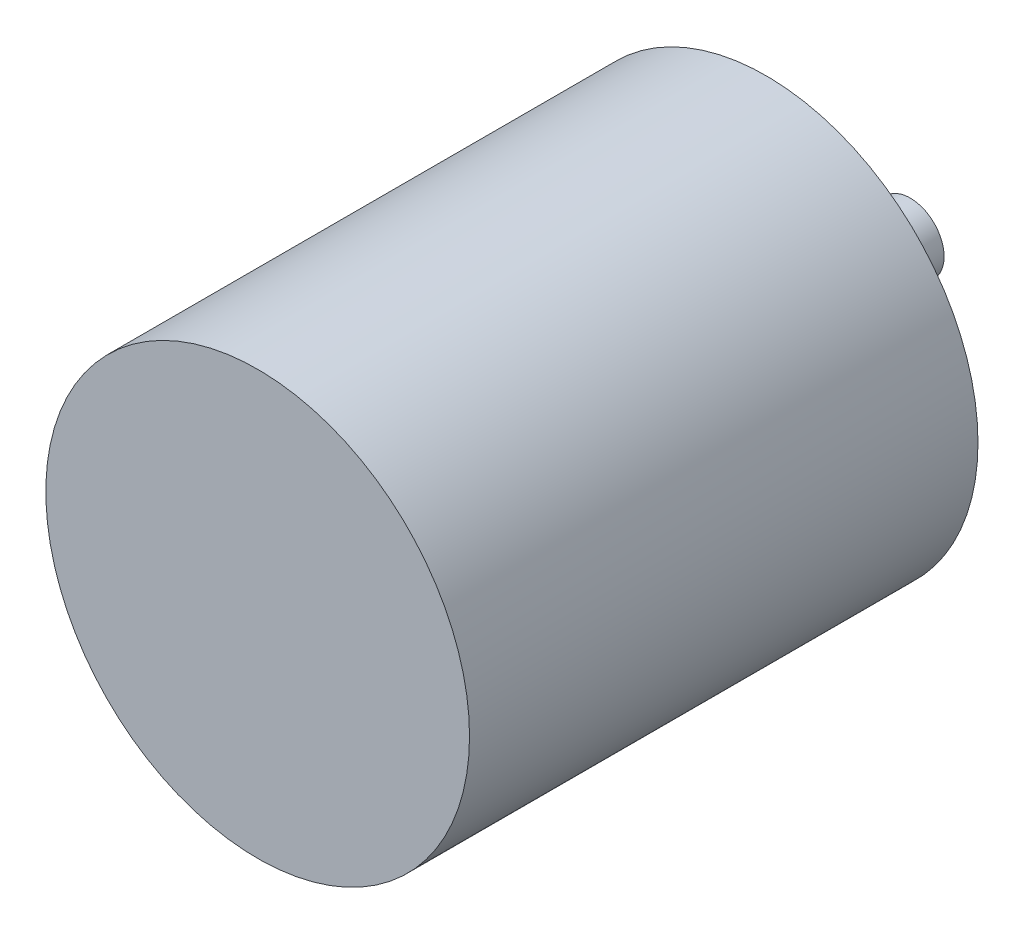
ISO-10303-21;
HEADER;
FILE_DESCRIPTION(('STEP AP214'),'2;1');
FILE_NAME('part.step','',(''),(''),'','','');
FILE_SCHEMA(('AUTOMOTIVE_DESIGN { 1 0 10303 214 1 1 1 1 }'));
ENDSEC;
DATA;
#1=APPLICATION_CONTEXT('core data for automotive mechanical design processes');
#2=APPLICATION_PROTOCOL_DEFINITION('international standard','automotive_design',2000,#1);
#3=PRODUCT_CONTEXT('',#1,'mechanical');
#4=PRODUCT('Part','Part','',(#3));
#5=PRODUCT_RELATED_PRODUCT_CATEGORY('part','',(#4));
#6=PRODUCT_DEFINITION_FORMATION('','',#4);
#7=PRODUCT_DEFINITION_CONTEXT('part definition',#1,'design');
#8=PRODUCT_DEFINITION('design','',#6,#7);
#9=PRODUCT_DEFINITION_SHAPE('','',#8);
#10=(LENGTH_UNIT() NAMED_UNIT(*) SI_UNIT(.MILLI.,.METRE.));
#11=(NAMED_UNIT(*) PLANE_ANGLE_UNIT() SI_UNIT($,.RADIAN.));
#12=(NAMED_UNIT(*) SI_UNIT($,.STERADIAN.) SOLID_ANGLE_UNIT());
#13=UNCERTAINTY_MEASURE_WITH_UNIT(LENGTH_MEASURE(1.E-05),#10,'distance_accuracy_value','');
#14=(GEOMETRIC_REPRESENTATION_CONTEXT(3) GLOBAL_UNCERTAINTY_ASSIGNED_CONTEXT((#13)) GLOBAL_UNIT_ASSIGNED_CONTEXT((#10,
#11,#12)) REPRESENTATION_CONTEXT('',''));
#15=CARTESIAN_POINT('',(0.,0.,0.));
#16=DIRECTION('',(0.,0.,1.));
#17=DIRECTION('',(1.,0.,0.));
#18=AXIS2_PLACEMENT_3D('',#15,#16,#17);
#19=CARTESIAN_POINT('',(0.,0.,60.));
#20=DIRECTION('',(0.,0.,-1.));
#21=DIRECTION('',(-1.,0.,0.));
#22=AXIS2_PLACEMENT_3D('',#19,#20,#21);
#23=CYLINDRICAL_SURFACE('',#22,25.);
#24=CARTESIAN_POINT('',(0.,0.,60.));
#25=DIRECTION('',(0.,0.,1.));
#26=DIRECTION('',(1.,0.,0.));
#27=AXIS2_PLACEMENT_3D('',#24,#25,#26);
#28=CIRCLE('',#27,25.);
#29=CARTESIAN_POINT('',(25.,0.,60.));
#30=VERTEX_POINT('',#29);
#31=EDGE_CURVE('E10',#30,#30,#28,.T.);
#32=ORIENTED_EDGE('',*,*,#31,.F.);
#33=EDGE_LOOP('',(#32));
#34=FACE_BOUND('',#33,.T.);
#35=CARTESIAN_POINT('',(0.,0.,0.));
#36=DIRECTION('',(0.,0.,1.));
#37=DIRECTION('',(1.,0.,0.));
#38=AXIS2_PLACEMENT_3D('',#35,#36,#37);
#39=CIRCLE('',#38,25.);
#40=CARTESIAN_POINT('',(25.,0.,0.));
#41=VERTEX_POINT('',#40);
#42=EDGE_CURVE('E46',#41,#41,#39,.T.);
#43=ORIENTED_EDGE('',*,*,#42,.T.);
#44=EDGE_LOOP('',(#43));
#45=FACE_BOUND('',#44,.T.);
#46=ADVANCED_FACE('F43',(#34,#45),#23,.T.);
#47=CARTESIAN_POINT('',(0.,0.,60.));
#48=DIRECTION('',(0.,0.,1.));
#49=DIRECTION('',(1.,0.,0.));
#50=AXIS2_PLACEMENT_3D('',#47,#48,#49);
#51=PLANE('',#50);
#52=ORIENTED_EDGE('',*,*,#31,.T.);
#53=EDGE_LOOP('',(#52));
#54=FACE_BOUND('',#53,.T.);
#55=ADVANCED_FACE('F103',(#54),#51,.T.);
#56=CARTESIAN_POINT('',(0.,0.,0.));
#57=DIRECTION('',(0.,0.,1.));
#58=DIRECTION('',(1.,0.,0.));
#59=AXIS2_PLACEMENT_3D('',#56,#57,#58);
#60=PLANE('',#59);
#61=CARTESIAN_POINT('',(-10.,-10.,0.));
#62=DIRECTION('',(0.,0.,-1.));
#63=DIRECTION('',(-1.,0.,0.));
#64=AXIS2_PLACEMENT_3D('',#61,#62,#63);
#65=CIRCLE('',#64,3.);
#66=CARTESIAN_POINT('',(-13.,-10.,0.));
#67=VERTEX_POINT('',#66);
#68=EDGE_CURVE('E77',#67,#67,#65,.T.);
#69=ORIENTED_EDGE('',*,*,#68,.F.);
#70=EDGE_LOOP('',(#69));
#71=FACE_BOUND('',#70,.T.);
#72=CARTESIAN_POINT('',(10.,-10.,0.));
#73=DIRECTION('',(0.,0.,-1.));
#74=DIRECTION('',(-1.,0.,0.));
#75=AXIS2_PLACEMENT_3D('',#72,#73,#74);
#76=CIRCLE('',#75,3.);
#77=CARTESIAN_POINT('',(7.,-10.,0.));
#78=VERTEX_POINT('',#77);
#79=EDGE_CURVE('E85',#78,#78,#76,.T.);
#80=ORIENTED_EDGE('',*,*,#79,.F.);
#81=EDGE_LOOP('',(#80));
#82=FACE_BOUND('',#81,.T.);
#83=CARTESIAN_POINT('',(10.,10.,0.));
#84=DIRECTION('',(0.,0.,-1.));
#85=DIRECTION('',(-1.,0.,0.));
#86=AXIS2_PLACEMENT_3D('',#83,#84,#85);
#87=CIRCLE('',#86,3.);
#88=CARTESIAN_POINT('',(7.,10.,0.));
#89=VERTEX_POINT('',#88);
#90=EDGE_CURVE('E69',#89,#89,#87,.T.);
#91=ORIENTED_EDGE('',*,*,#90,.F.);
#92=EDGE_LOOP('',(#91));
#93=FACE_BOUND('',#92,.T.);
#94=CARTESIAN_POINT('',(-10.,10.,0.));
#95=DIRECTION('',(0.,0.,-1.));
#96=DIRECTION('',(-1.,0.,0.));
#97=AXIS2_PLACEMENT_3D('',#94,#95,#96);
#98=CIRCLE('',#97,3.);
#99=CARTESIAN_POINT('',(-13.,10.,0.));
#100=VERTEX_POINT('',#99);
#101=EDGE_CURVE('E65',#100,#100,#98,.T.);
#102=ORIENTED_EDGE('',*,*,#101,.F.);
#103=EDGE_LOOP('',(#102));
#104=FACE_BOUND('',#103,.T.);
#105=CARTESIAN_POINT('',(0.,0.,0.));
#106=DIRECTION('',(0.,0.,1.));
#107=DIRECTION('',(1.,0.,0.));
#108=AXIS2_PLACEMENT_3D('',#105,#106,#107);
#109=CIRCLE('',#108,4.);
#110=CARTESIAN_POINT('',(4.,0.,0.));
#111=VERTEX_POINT('',#110);
#112=EDGE_CURVE('E57',#111,#111,#109,.T.);
#113=ORIENTED_EDGE('',*,*,#112,.T.);
#114=EDGE_LOOP('',(#113));
#115=FACE_BOUND('',#114,.T.);
#116=ORIENTED_EDGE('',*,*,#42,.F.);
#117=EDGE_LOOP('',(#116));
#118=FACE_BOUND('',#117,.T.);
#119=ADVANCED_FACE('F99',(#71,#82,#93,#104,#115,#118),#60,.F.);
#120=CARTESIAN_POINT('',(0.,0.,-17.));
#121=DIRECTION('',(0.,0.,1.));
#122=DIRECTION('',(1.,0.,0.));
#123=AXIS2_PLACEMENT_3D('',#120,#121,#122);
#124=CYLINDRICAL_SURFACE('',#123,4.);
#125=CARTESIAN_POINT('',(0.,0.,-17.));
#126=DIRECTION('',(0.,0.,1.));
#127=DIRECTION('',(1.,0.,0.));
#128=AXIS2_PLACEMENT_3D('',#125,#126,#127);
#129=CIRCLE('',#128,4.);
#130=CARTESIAN_POINT('',(4.,0.,-17.));
#131=VERTEX_POINT('',#130);
#132=EDGE_CURVE('E55',#131,#131,#129,.T.);
#133=ORIENTED_EDGE('',*,*,#132,.T.);
#134=EDGE_LOOP('',(#133));
#135=FACE_BOUND('',#134,.T.);
#136=ORIENTED_EDGE('',*,*,#112,.F.);
#137=EDGE_LOOP('',(#136));
#138=FACE_BOUND('',#137,.T.);
#139=ADVANCED_FACE('F102',(#135,#138),#124,.T.);
#140=CARTESIAN_POINT('',(0.,0.,-17.));
#141=DIRECTION('',(0.,0.,1.));
#142=DIRECTION('',(1.,0.,0.));
#143=AXIS2_PLACEMENT_3D('',#140,#141,#142);
#144=PLANE('',#143);
#145=ORIENTED_EDGE('',*,*,#132,.F.);
#146=EDGE_LOOP('',(#145));
#147=FACE_BOUND('',#146,.T.);
#148=ADVANCED_FACE('F122',(#147),#144,.F.);
#149=CARTESIAN_POINT('',(-10.,10.,7.));
#150=DIRECTION('',(0.,0.,-1.));
#151=DIRECTION('',(-1.,0.,0.));
#152=AXIS2_PLACEMENT_3D('',#149,#150,#151);
#153=CYLINDRICAL_SURFACE('',#152,3.);
#154=CARTESIAN_POINT('',(-10.,10.,7.));
#155=DIRECTION('',(0.,0.,-1.));
#156=DIRECTION('',(-1.,0.,0.));
#157=AXIS2_PLACEMENT_3D('',#154,#155,#156);
#158=CIRCLE('',#157,3.);
#159=CARTESIAN_POINT('',(-13.,10.,7.));
#160=VERTEX_POINT('',#159);
#161=EDGE_CURVE('E61',#160,#160,#158,.T.);
#162=ORIENTED_EDGE('',*,*,#161,.F.);
#163=EDGE_LOOP('',(#162));
#164=FACE_BOUND('',#163,.T.);
#165=ORIENTED_EDGE('',*,*,#101,.T.);
#166=EDGE_LOOP('',(#165));
#167=FACE_BOUND('',#166,.T.);
#168=ADVANCED_FACE('F126',(#164,#167),#153,.F.);
#169=CARTESIAN_POINT('',(-10.,10.,7.));
#170=DIRECTION('',(0.,0.,-1.));
#171=DIRECTION('',(-1.,0.,0.));
#172=AXIS2_PLACEMENT_3D('',#169,#170,#171);
#173=PLANE('',#172);
#174=ORIENTED_EDGE('',*,*,#161,.T.);
#175=EDGE_LOOP('',(#174));
#176=FACE_BOUND('',#175,.T.);
#177=ADVANCED_FACE('F130',(#176),#173,.T.);
#178=CARTESIAN_POINT('',(10.,10.,7.));
#179=DIRECTION('',(0.,0.,-1.));
#180=DIRECTION('',(-1.,0.,0.));
#181=AXIS2_PLACEMENT_3D('',#178,#179,#180);
#182=CYLINDRICAL_SURFACE('',#181,3.);
#183=CARTESIAN_POINT('',(10.,10.,7.));
#184=DIRECTION('',(0.,0.,-1.));
#185=DIRECTION('',(-1.,0.,0.));
#186=AXIS2_PLACEMENT_3D('',#183,#184,#185);
#187=CIRCLE('',#186,3.);
#188=CARTESIAN_POINT('',(7.,10.,7.));
#189=VERTEX_POINT('',#188);
#190=EDGE_CURVE('E89',#189,#189,#187,.T.);
#191=ORIENTED_EDGE('',*,*,#190,.F.);
#192=EDGE_LOOP('',(#191));
#193=FACE_BOUND('',#192,.T.);
#194=ORIENTED_EDGE('',*,*,#90,.T.);
#195=EDGE_LOOP('',(#194));
#196=FACE_BOUND('',#195,.T.);
#197=ADVANCED_FACE('F97',(#193,#196),#182,.F.);
#198=CARTESIAN_POINT('',(10.,10.,7.));
#199=DIRECTION('',(0.,0.,-1.));
#200=DIRECTION('',(-1.,0.,0.));
#201=AXIS2_PLACEMENT_3D('',#198,#199,#200);
#202=PLANE('',#201);
#203=ORIENTED_EDGE('',*,*,#190,.T.);
#204=EDGE_LOOP('',(#203));
#205=FACE_BOUND('',#204,.T.);
#206=ADVANCED_FACE('F150',(#205),#202,.T.);
#207=CARTESIAN_POINT('',(10.,-10.,7.));
#208=DIRECTION('',(0.,0.,-1.));
#209=DIRECTION('',(-1.,0.,0.));
#210=AXIS2_PLACEMENT_3D('',#207,#208,#209);
#211=CYLINDRICAL_SURFACE('',#210,3.);
#212=CARTESIAN_POINT('',(10.,-10.,7.));
#213=DIRECTION('',(0.,0.,-1.));
#214=DIRECTION('',(-1.,0.,0.));
#215=AXIS2_PLACEMENT_3D('',#212,#213,#214);
#216=CIRCLE('',#215,3.);
#217=CARTESIAN_POINT('',(7.,-10.,7.));
#218=VERTEX_POINT('',#217);
#219=EDGE_CURVE('E81',#218,#218,#216,.T.);
#220=ORIENTED_EDGE('',*,*,#219,.F.);
#221=EDGE_LOOP('',(#220));
#222=FACE_BOUND('',#221,.T.);
#223=ORIENTED_EDGE('',*,*,#79,.T.);
#224=EDGE_LOOP('',(#223));
#225=FACE_BOUND('',#224,.T.);
#226=ADVANCED_FACE('F146',(#222,#225),#211,.F.);
#227=CARTESIAN_POINT('',(10.,-10.,7.));
#228=DIRECTION('',(0.,0.,-1.));
#229=DIRECTION('',(-1.,0.,0.));
#230=AXIS2_PLACEMENT_3D('',#227,#228,#229);
#231=PLANE('',#230);
#232=ORIENTED_EDGE('',*,*,#219,.T.);
#233=EDGE_LOOP('',(#232));
#234=FACE_BOUND('',#233,.T.);
#235=ADVANCED_FACE('F142',(#234),#231,.T.);
#236=CARTESIAN_POINT('',(-10.,-10.,7.));
#237=DIRECTION('',(0.,0.,-1.));
#238=DIRECTION('',(-1.,0.,0.));
#239=AXIS2_PLACEMENT_3D('',#236,#237,#238);
#240=CYLINDRICAL_SURFACE('',#239,3.);
#241=CARTESIAN_POINT('',(-10.,-10.,7.));
#242=DIRECTION('',(0.,0.,-1.));
#243=DIRECTION('',(-1.,0.,0.));
#244=AXIS2_PLACEMENT_3D('',#241,#242,#243);
#245=CIRCLE('',#244,3.);
#246=CARTESIAN_POINT('',(-13.,-10.,7.));
#247=VERTEX_POINT('',#246);
#248=EDGE_CURVE('E73',#247,#247,#245,.T.);
#249=ORIENTED_EDGE('',*,*,#248,.F.);
#250=EDGE_LOOP('',(#249));
#251=FACE_BOUND('',#250,.T.);
#252=ORIENTED_EDGE('',*,*,#68,.T.);
#253=EDGE_LOOP('',(#252));
#254=FACE_BOUND('',#253,.T.);
#255=ADVANCED_FACE('F138',(#251,#254),#240,.F.);
#256=CARTESIAN_POINT('',(-10.,-10.,7.));
#257=DIRECTION('',(0.,0.,-1.));
#258=DIRECTION('',(-1.,0.,0.));
#259=AXIS2_PLACEMENT_3D('',#256,#257,#258);
#260=PLANE('',#259);
#261=ORIENTED_EDGE('',*,*,#248,.T.);
#262=EDGE_LOOP('',(#261));
#263=FACE_BOUND('',#262,.T.);
#264=ADVANCED_FACE('F135',(#263),#260,.T.);
#265=CLOSED_SHELL('',(#46,#55,#119,#139,#148,#168,#177,#197,#206,#226,#235,#255,#264));
#266=MANIFOLD_SOLID_BREP('B2',#265);
#267=ADVANCED_BREP_SHAPE_REPRESENTATION('',(#18,#266),#14);
#268=SHAPE_DEFINITION_REPRESENTATION(#9,#267);
ENDSEC;
END-ISO-10303-21;
